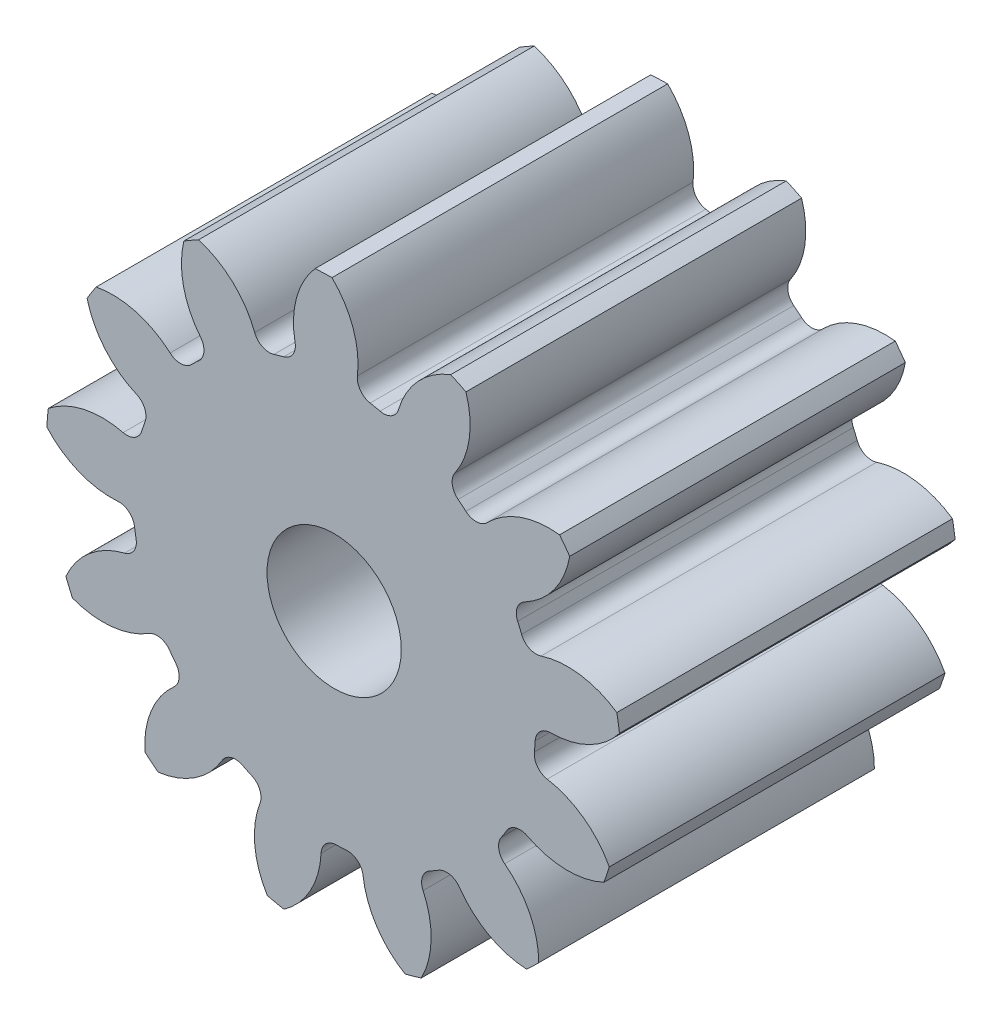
from build123d import *

# Parameters (mm, degrees)
SKETCH3_R         = 76.2
GEARBODY_DEPTH    = 88.9
TOOTHCUT_DEPTH    = 140.7
CIRPATTERN1_COUNT = 13
BOREDIA_R         = 17.78
BORE_DEPTH        = 12700


with BuildPart() as part:
    # Sketch3 → gearBody (new body)
    with BuildSketch(Plane.XY):
        Circle(SKETCH3_R)
    extrude(amount=GEARBODY_DEPTH)

    # Sketch2 → toothCut (cut, through all)
    with BuildSketch(Plane.XY):
        with BuildLine():
            ThreePointArc((53.022736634, -5.809044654), (53.151931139, -4.475244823), (53.247578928, -3.138620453))
            ThreePointArc((53.247578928, -3.138620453), (54.536561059, -0.375370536), (57.369122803, 0.753176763))
            ThreePointArc((57.369122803, 0.753176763), (67.990480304, 3.371717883), (76.2, 10.601778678))
            ThreePointArc((76.2, 10.601778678), (76.662725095, -6.454788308), (73.354501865, -23.193851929))
            ThreePointArc((73.354501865, -23.193851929), (66.469491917, -14.692873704), (56.43551142, -10.335210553))
            ThreePointArc((56.43551142, -10.335210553), (53.831531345, -8.748921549), (53.022736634, -5.809044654))
        make_face()
    toothcut = extrude(amount=TOOTHCUT_DEPTH, mode=Mode.SUBTRACT)

    # CirPattern1: toothCut ×13 about axis
    cirpattern1_axis = Axis((0, 0, 0), (0, 0, 1))
    for i in range(1, CIRPATTERN1_COUNT):
        add(toothcut.rotate(cirpattern1_axis, i * 360 / CIRPATTERN1_COUNT), mode=Mode.SUBTRACT)

    # boreDia → bore (cut, symmetric)
    with BuildSketch(Plane.XY):
        Circle(BOREDIA_R)
    extrude(amount=BORE_DEPTH, both=True, mode=Mode.SUBTRACT)


solid = part.part
